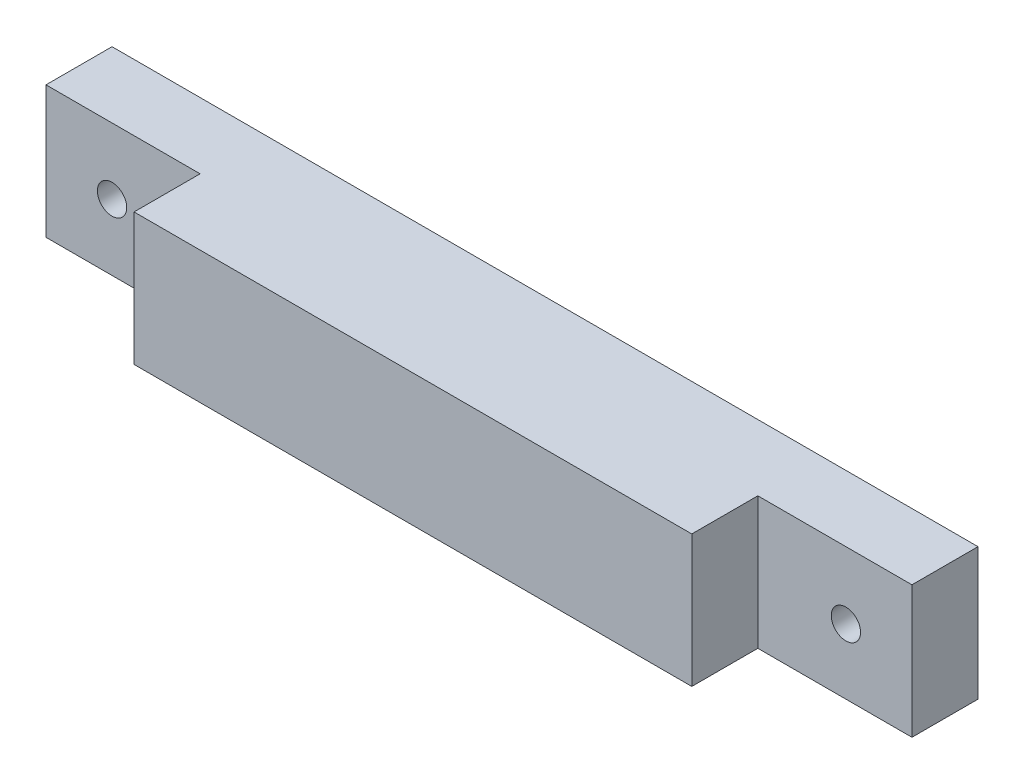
from build123d import *

# Parameters (mm, degrees)
ESQUISSE1_W             = 59
ESQUISSE1_H             = 9
EXTRUSION1_DEPTH        = 9
ESQUISSE2_W             = 10.5
ESQUISSE2_H             = 9
ENL_V_MAT_EXTRU_1_DEPTH = 4.5
ESQUISSE4_R             = 1
ENL_V_MAT_EXTRU_2_DEPTH = 4.5


with BuildPart() as part:
    # Esquisse1 → Extrusion1 (new body)
    with BuildSketch(Plane.XY):
        with Locations((29.5, 4.5)):
            Rectangle(ESQUISSE1_W, ESQUISSE1_H)
    extrude(amount=EXTRUSION1_DEPTH)

    # Esquisse2 → Enl_v. mat.-Extru.1 (cut)
    with BuildSketch(Plane.XY.offset(9)):
        with Locations((5.25, 4.5)):
            Rectangle(ESQUISSE2_W, ESQUISSE2_H)
        with Locations((53.75, 4.5)):
            Rectangle(ESQUISSE2_W, ESQUISSE2_H)
    extrude(amount=-ENL_V_MAT_EXTRU_1_DEPTH, mode=Mode.SUBTRACT)

    # Esquisse4 → Enl_v. mat.-Extru.2 (cut)
    with BuildSketch(Plane.XY.offset(4.5)):
        with Locations((4.5, 4.5)):
            Circle(ESQUISSE4_R)
        with Locations((54.5, 4.437059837)):
            Circle(ESQUISSE4_R)
    extrude(amount=-ENL_V_MAT_EXTRU_2_DEPTH, mode=Mode.SUBTRACT)


solid = part.part
